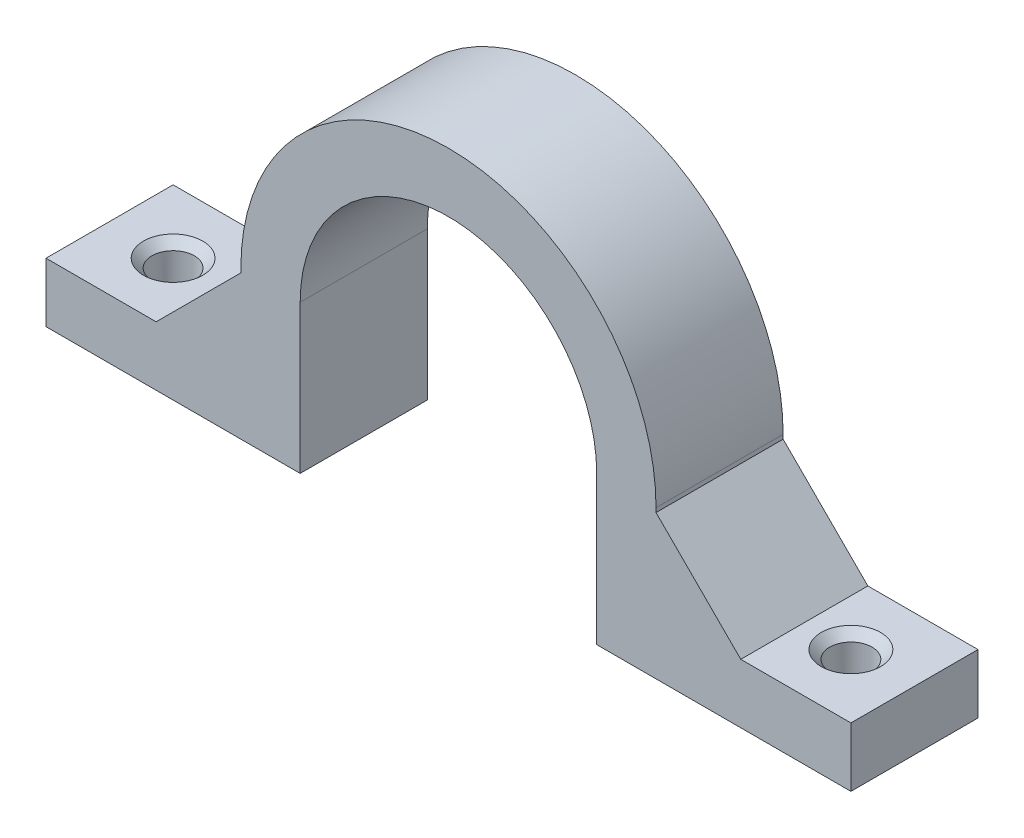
ISO-10303-21;
HEADER;
FILE_DESCRIPTION(('STEP AP214'),'2;1');
FILE_NAME('part.step','',(''),(''),'','','');
FILE_SCHEMA(('AUTOMOTIVE_DESIGN { 1 0 10303 214 1 1 1 1 }'));
ENDSEC;
DATA;
#1=APPLICATION_CONTEXT('core data for automotive mechanical design processes');
#2=APPLICATION_PROTOCOL_DEFINITION('international standard','automotive_design',2000,#1);
#3=PRODUCT_CONTEXT('',#1,'mechanical');
#4=PRODUCT('Part','Part','',(#3));
#5=PRODUCT_RELATED_PRODUCT_CATEGORY('part','',(#4));
#6=PRODUCT_DEFINITION_FORMATION('','',#4);
#7=PRODUCT_DEFINITION_CONTEXT('part definition',#1,'design');
#8=PRODUCT_DEFINITION('design','',#6,#7);
#9=PRODUCT_DEFINITION_SHAPE('','',#8);
#10=(LENGTH_UNIT() NAMED_UNIT(*) SI_UNIT(.MILLI.,.METRE.));
#11=(NAMED_UNIT(*) PLANE_ANGLE_UNIT() SI_UNIT($,.RADIAN.));
#12=(NAMED_UNIT(*) SI_UNIT($,.STERADIAN.) SOLID_ANGLE_UNIT());
#13=UNCERTAINTY_MEASURE_WITH_UNIT(LENGTH_MEASURE(1.E-05),#10,'distance_accuracy_value','');
#14=(GEOMETRIC_REPRESENTATION_CONTEXT(3) GLOBAL_UNCERTAINTY_ASSIGNED_CONTEXT((#13)) GLOBAL_UNIT_ASSIGNED_CONTEXT((#10,
#11,#12)) REPRESENTATION_CONTEXT('',''));
#15=CARTESIAN_POINT('',(0.,0.,0.));
#16=DIRECTION('',(0.,0.,1.));
#17=DIRECTION('',(1.,0.,0.));
#18=AXIS2_PLACEMENT_3D('',#15,#16,#17);
#19=CARTESIAN_POINT('',(0.,7.,15.));
#20=DIRECTION('',(1.,0.,0.));
#21=DIRECTION('',(0.,0.,-1.));
#22=AXIS2_PLACEMENT_3D('',#19,#20,#21);
#23=PLANE('',#22);
#24=DIRECTION('',(0.,-1.,0.));
#25=VECTOR('',#24,1.);
#26=CARTESIAN_POINT('',(0.,7.,0.));
#27=LINE('',#26,#25);
#28=CARTESIAN_POINT('',(0.,7.,0.));
#29=VERTEX_POINT('',#28);
#30=CARTESIAN_POINT('',(0.,0.,0.));
#31=VERTEX_POINT('',#30);
#32=EDGE_CURVE('E164',#29,#31,#27,.T.);
#33=ORIENTED_EDGE('',*,*,#32,.T.);
#34=DIRECTION('',(0.,0.,-1.));
#35=VECTOR('',#34,1.);
#36=CARTESIAN_POINT('',(0.,0.,15.));
#37=LINE('',#36,#35);
#38=CARTESIAN_POINT('',(0.,0.,15.));
#39=VERTEX_POINT('',#38);
#40=EDGE_CURVE('E145',#39,#31,#37,.T.);
#41=ORIENTED_EDGE('',*,*,#40,.F.);
#42=DIRECTION('',(0.,-1.,0.));
#43=VECTOR('',#42,1.);
#44=CARTESIAN_POINT('',(0.,7.,15.));
#45=LINE('',#44,#43);
#46=CARTESIAN_POINT('',(0.,7.,15.));
#47=VERTEX_POINT('',#46);
#48=EDGE_CURVE('E152',#47,#39,#45,.T.);
#49=ORIENTED_EDGE('',*,*,#48,.F.);
#50=DIRECTION('',(0.,0.,-1.));
#51=VECTOR('',#50,1.);
#52=CARTESIAN_POINT('',(0.,7.,15.));
#53=LINE('',#52,#51);
#54=EDGE_CURVE('E261',#47,#29,#53,.T.);
#55=ORIENTED_EDGE('',*,*,#54,.T.);
#56=EDGE_LOOP('',(#33,#41,#49,#55));
#57=FACE_BOUND('',#56,.T.);
#58=ADVANCED_FACE('F37',(#57),#23,.F.);
#59=CARTESIAN_POINT('',(0.,0.,15.));
#60=DIRECTION('',(0.,1.,0.));
#61=DIRECTION('',(0.,0.,1.));
#62=AXIS2_PLACEMENT_3D('',#59,#60,#61);
#63=PLANE('',#62);
#64=CARTESIAN_POINT('',(7.5,0.,7.5));
#65=DIRECTION('',(0.,1.,0.));
#66=DIRECTION('',(0.,0.,1.));
#67=AXIS2_PLACEMENT_3D('',#64,#65,#66);
#68=CIRCLE('',#67,2.5);
#69=CARTESIAN_POINT('',(7.5,0.,10.));
#70=VERTEX_POINT('',#69);
#71=EDGE_CURVE('E333',#70,#70,#68,.T.);
#72=ORIENTED_EDGE('',*,*,#71,.T.);
#73=EDGE_LOOP('',(#72));
#74=FACE_BOUND('',#73,.T.);
#75=DIRECTION('',(1.,0.,0.));
#76=VECTOR('',#75,1.);
#77=CARTESIAN_POINT('',(0.,0.,0.));
#78=LINE('',#77,#76);
#79=CARTESIAN_POINT('',(30.,0.,0.));
#80=VERTEX_POINT('',#79);
#81=EDGE_CURVE('E263',#31,#80,#78,.T.);
#82=ORIENTED_EDGE('',*,*,#81,.T.);
#83=DIRECTION('',(0.,0.,-1.));
#84=VECTOR('',#83,1.);
#85=CARTESIAN_POINT('',(30.,0.,15.));
#86=LINE('',#85,#84);
#87=CARTESIAN_POINT('',(30.,0.,15.));
#88=VERTEX_POINT('',#87);
#89=EDGE_CURVE('E148',#88,#80,#86,.T.);
#90=ORIENTED_EDGE('',*,*,#89,.F.);
#91=DIRECTION('',(1.,0.,0.));
#92=VECTOR('',#91,1.);
#93=CARTESIAN_POINT('',(0.,0.,15.));
#94=LINE('',#93,#92);
#95=EDGE_CURVE('E141',#39,#88,#94,.T.);
#96=ORIENTED_EDGE('',*,*,#95,.F.);
#97=ORIENTED_EDGE('',*,*,#40,.T.);
#98=EDGE_LOOP('',(#82,#90,#96,#97));
#99=FACE_BOUND('',#98,.T.);
#100=ADVANCED_FACE('F143',(#74,#99),#63,.F.);
#101=CARTESIAN_POINT('',(30.,0.,15.));
#102=DIRECTION('',(-1.,0.,0.));
#103=DIRECTION('',(0.,-1.,0.));
#104=AXIS2_PLACEMENT_3D('',#101,#102,#103);
#105=PLANE('',#104);
#106=DIRECTION('',(0.,1.,0.));
#107=VECTOR('',#106,1.);
#108=CARTESIAN_POINT('',(30.,0.,0.));
#109=LINE('',#108,#107);
#110=CARTESIAN_POINT('',(30.,17.5,0.));
#111=VERTEX_POINT('',#110);
#112=EDGE_CURVE('E266',#80,#111,#109,.T.);
#113=ORIENTED_EDGE('',*,*,#112,.T.);
#114=DIRECTION('',(0.,0.,-1.));
#115=VECTOR('',#114,1.);
#116=CARTESIAN_POINT('',(30.,17.5,15.));
#117=LINE('',#116,#115);
#118=CARTESIAN_POINT('',(30.,17.5,15.));
#119=VERTEX_POINT('',#118);
#120=EDGE_CURVE('E170',#119,#111,#117,.T.);
#121=ORIENTED_EDGE('',*,*,#120,.F.);
#122=DIRECTION('',(0.,1.,0.));
#123=VECTOR('',#122,1.);
#124=CARTESIAN_POINT('',(30.,0.,15.));
#125=LINE('',#124,#123);
#126=EDGE_CURVE('E151',#88,#119,#125,.T.);
#127=ORIENTED_EDGE('',*,*,#126,.F.);
#128=ORIENTED_EDGE('',*,*,#89,.T.);
#129=EDGE_LOOP('',(#113,#121,#127,#128));
#130=FACE_BOUND('',#129,.T.);
#131=ADVANCED_FACE('F211',(#130),#105,.F.);
#132=CARTESIAN_POINT('',(47.5,17.5,15.));
#133=DIRECTION('',(0.,0.,-1.));
#134=DIRECTION('',(-1.,0.,0.));
#135=AXIS2_PLACEMENT_3D('',#132,#133,#134);
#136=CYLINDRICAL_SURFACE('',#135,17.5);
#137=CARTESIAN_POINT('',(47.5,17.5,0.));
#138=DIRECTION('',(0.,0.,-1.));
#139=DIRECTION('',(-1.,0.,0.));
#140=AXIS2_PLACEMENT_3D('',#137,#138,#139);
#141=CIRCLE('',#140,17.5);
#142=CARTESIAN_POINT('',(65.,17.5,0.));
#143=VERTEX_POINT('',#142);
#144=EDGE_CURVE('E268',#111,#143,#141,.T.);
#145=ORIENTED_EDGE('',*,*,#144,.T.);
#146=DIRECTION('',(0.,0.,-1.));
#147=VECTOR('',#146,1.);
#148=CARTESIAN_POINT('',(65.,17.5,15.));
#149=LINE('',#148,#147);
#150=CARTESIAN_POINT('',(65.,17.5,15.));
#151=VERTEX_POINT('',#150);
#152=EDGE_CURVE('E300',#151,#143,#149,.T.);
#153=ORIENTED_EDGE('',*,*,#152,.F.);
#154=CARTESIAN_POINT('',(47.5,17.5,15.));
#155=DIRECTION('',(0.,0.,-1.));
#156=DIRECTION('',(-1.,0.,0.));
#157=AXIS2_PLACEMENT_3D('',#154,#155,#156);
#158=CIRCLE('',#157,17.5);
#159=EDGE_CURVE('E309',#119,#151,#158,.T.);
#160=ORIENTED_EDGE('',*,*,#159,.F.);
#161=ORIENTED_EDGE('',*,*,#120,.T.);
#162=EDGE_LOOP('',(#145,#153,#160,#161));
#163=FACE_BOUND('',#162,.T.);
#164=ADVANCED_FACE('F307',(#163),#136,.F.);
#165=CARTESIAN_POINT('',(65.,17.5,15.));
#166=DIRECTION('',(1.,0.,0.));
#167=DIRECTION('',(0.,0.,-1.));
#168=AXIS2_PLACEMENT_3D('',#165,#166,#167);
#169=PLANE('',#168);
#170=DIRECTION('',(0.,-1.,0.));
#171=VECTOR('',#170,1.);
#172=CARTESIAN_POINT('',(65.,17.5,0.));
#173=LINE('',#172,#171);
#174=CARTESIAN_POINT('',(65.,0.,0.));
#175=VERTEX_POINT('',#174);
#176=EDGE_CURVE('E270',#143,#175,#173,.T.);
#177=ORIENTED_EDGE('',*,*,#176,.T.);
#178=DIRECTION('',(0.,0.,-1.));
#179=VECTOR('',#178,1.);
#180=CARTESIAN_POINT('',(65.,0.,15.));
#181=LINE('',#180,#179);
#182=CARTESIAN_POINT('',(65.,0.,15.));
#183=VERTEX_POINT('',#182);
#184=EDGE_CURVE('E297',#183,#175,#181,.T.);
#185=ORIENTED_EDGE('',*,*,#184,.F.);
#186=DIRECTION('',(0.,-1.,0.));
#187=VECTOR('',#186,1.);
#188=CARTESIAN_POINT('',(65.,17.5,15.));
#189=LINE('',#188,#187);
#190=EDGE_CURVE('E325',#151,#183,#189,.T.);
#191=ORIENTED_EDGE('',*,*,#190,.F.);
#192=ORIENTED_EDGE('',*,*,#152,.T.);
#193=EDGE_LOOP('',(#177,#185,#191,#192));
#194=FACE_BOUND('',#193,.T.);
#195=ADVANCED_FACE('F317',(#194),#169,.F.);
#196=CARTESIAN_POINT('',(65.,0.,15.));
#197=DIRECTION('',(0.,1.,0.));
#198=DIRECTION('',(0.,0.,1.));
#199=AXIS2_PLACEMENT_3D('',#196,#197,#198);
#200=PLANE('',#199);
#201=CARTESIAN_POINT('',(87.5,0.,7.5));
#202=DIRECTION('',(0.,1.,0.));
#203=DIRECTION('',(0.,0.,1.));
#204=AXIS2_PLACEMENT_3D('',#201,#202,#203);
#205=CIRCLE('',#204,2.5);
#206=CARTESIAN_POINT('',(87.5,0.,9.99999999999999));
#207=VERTEX_POINT('',#206);
#208=EDGE_CURVE('E264',#207,#207,#205,.T.);
#209=ORIENTED_EDGE('',*,*,#208,.T.);
#210=EDGE_LOOP('',(#209));
#211=FACE_BOUND('',#210,.T.);
#212=DIRECTION('',(1.,0.,0.));
#213=VECTOR('',#212,1.);
#214=CARTESIAN_POINT('',(65.,0.,0.));
#215=LINE('',#214,#213);
#216=CARTESIAN_POINT('',(95.,0.,0.));
#217=VERTEX_POINT('',#216);
#218=EDGE_CURVE('E272',#175,#217,#215,.T.);
#219=ORIENTED_EDGE('',*,*,#218,.T.);
#220=DIRECTION('',(0.,0.,-1.));
#221=VECTOR('',#220,1.);
#222=CARTESIAN_POINT('',(95.,0.,15.));
#223=LINE('',#222,#221);
#224=CARTESIAN_POINT('',(95.,0.,15.));
#225=VERTEX_POINT('',#224);
#226=EDGE_CURVE('E294',#225,#217,#223,.T.);
#227=ORIENTED_EDGE('',*,*,#226,.F.);
#228=DIRECTION('',(1.,0.,0.));
#229=VECTOR('',#228,1.);
#230=CARTESIAN_POINT('',(65.,0.,15.));
#231=LINE('',#230,#229);
#232=EDGE_CURVE('E323',#183,#225,#231,.T.);
#233=ORIENTED_EDGE('',*,*,#232,.F.);
#234=ORIENTED_EDGE('',*,*,#184,.T.);
#235=EDGE_LOOP('',(#219,#227,#233,#234));
#236=FACE_BOUND('',#235,.T.);
#237=ADVANCED_FACE('F321',(#211,#236),#200,.F.);
#238=CARTESIAN_POINT('',(95.,7.,15.));
#239=DIRECTION('',(-1.,0.,0.));
#240=DIRECTION('',(0.,0.,1.));
#241=AXIS2_PLACEMENT_3D('',#238,#239,#240);
#242=PLANE('',#241);
#243=DIRECTION('',(0.,1.,0.));
#244=VECTOR('',#243,1.);
#245=CARTESIAN_POINT('',(95.,7.,0.));
#246=LINE('',#245,#244);
#247=CARTESIAN_POINT('',(95.,7.,0.));
#248=VERTEX_POINT('',#247);
#249=EDGE_CURVE('E274',#217,#248,#246,.T.);
#250=ORIENTED_EDGE('',*,*,#249,.T.);
#251=DIRECTION('',(0.,0.,-1.));
#252=VECTOR('',#251,1.);
#253=CARTESIAN_POINT('',(95.,7.,15.));
#254=LINE('',#253,#252);
#255=CARTESIAN_POINT('',(95.,7.,15.));
#256=VERTEX_POINT('',#255);
#257=EDGE_CURVE('E291',#256,#248,#254,.T.);
#258=ORIENTED_EDGE('',*,*,#257,.F.);
#259=DIRECTION('',(0.,1.,0.));
#260=VECTOR('',#259,1.);
#261=CARTESIAN_POINT('',(95.,7.,15.));
#262=LINE('',#261,#260);
#263=EDGE_CURVE('E254',#225,#256,#262,.T.);
#264=ORIENTED_EDGE('',*,*,#263,.F.);
#265=ORIENTED_EDGE('',*,*,#226,.T.);
#266=EDGE_LOOP('',(#250,#258,#264,#265));
#267=FACE_BOUND('',#266,.T.);
#268=ADVANCED_FACE('F366',(#267),#242,.F.);
#269=CARTESIAN_POINT('',(72.,7.,15.));
#270=DIRECTION('',(0.,-1.,0.));
#271=DIRECTION('',(0.,0.,-1.));
#272=AXIS2_PLACEMENT_3D('',#269,#270,#271);
#273=PLANE('',#272);
#274=CARTESIAN_POINT('',(87.5,7.,7.5));
#275=DIRECTION('',(0.,-1.,0.));
#276=DIRECTION('',(0.,0.,-1.));
#277=AXIS2_PLACEMENT_3D('',#274,#275,#276);
#278=CIRCLE('',#277,3.50000000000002);
#279=CARTESIAN_POINT('',(87.5,7.,3.99999999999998));
#280=VERTEX_POINT('',#279);
#281=EDGE_CURVE('E189',#280,#280,#278,.T.);
#282=ORIENTED_EDGE('',*,*,#281,.T.);
#283=EDGE_LOOP('',(#282));
#284=FACE_BOUND('',#283,.T.);
#285=DIRECTION('',(-1.,0.,0.));
#286=VECTOR('',#285,1.);
#287=CARTESIAN_POINT('',(72.,7.,0.));
#288=LINE('',#287,#286);
#289=CARTESIAN_POINT('',(82.,7.,0.));
#290=VERTEX_POINT('',#289);
#291=EDGE_CURVE('E276',#248,#290,#288,.T.);
#292=ORIENTED_EDGE('',*,*,#291,.T.);
#293=DIRECTION('',(0.,0.,1.));
#294=VECTOR('',#293,1.);
#295=CARTESIAN_POINT('',(82.,7.,15.));
#296=LINE('',#295,#294);
#297=CARTESIAN_POINT('',(82.,7.,15.));
#298=VERTEX_POINT('',#297);
#299=EDGE_CURVE('E53',#290,#298,#296,.T.);
#300=ORIENTED_EDGE('',*,*,#299,.T.);
#301=DIRECTION('',(-1.,0.,0.));
#302=VECTOR('',#301,1.);
#303=CARTESIAN_POINT('',(72.,7.,15.));
#304=LINE('',#303,#302);
#305=EDGE_CURVE('E244',#256,#298,#304,.T.);
#306=ORIENTED_EDGE('',*,*,#305,.F.);
#307=ORIENTED_EDGE('',*,*,#257,.T.);
#308=EDGE_LOOP('',(#292,#300,#306,#307));
#309=FACE_BOUND('',#308,.T.);
#310=ADVANCED_FACE('F363',(#284,#309),#273,.F.);
#311=CARTESIAN_POINT('',(72.,17.5,15.));
#312=DIRECTION('',(-1.,0.,0.));
#313=DIRECTION('',(0.,0.,1.));
#314=AXIS2_PLACEMENT_3D('',#311,#312,#313);
#315=PLANE('',#314);
#316=DIRECTION('',(0.,1.,0.));
#317=VECTOR('',#316,1.);
#318=CARTESIAN_POINT('',(72.,17.5,15.));
#319=LINE('',#318,#317);
#320=CARTESIAN_POINT('',(72.,17.0000000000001,15.));
#321=VERTEX_POINT('',#320);
#322=CARTESIAN_POINT('',(72.,17.5,15.));
#323=VERTEX_POINT('',#322);
#324=EDGE_CURVE('E242',#321,#323,#319,.T.);
#325=ORIENTED_EDGE('',*,*,#324,.F.);
#326=DIRECTION('',(0.,0.,-1.));
#327=VECTOR('',#326,1.);
#328=CARTESIAN_POINT('',(72.,17.0000000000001,0.));
#329=LINE('',#328,#327);
#330=CARTESIAN_POINT('',(72.,17.0000000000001,0.));
#331=VERTEX_POINT('',#330);
#332=EDGE_CURVE('E175',#321,#331,#329,.T.);
#333=ORIENTED_EDGE('',*,*,#332,.T.);
#334=DIRECTION('',(0.,1.,0.));
#335=VECTOR('',#334,1.);
#336=CARTESIAN_POINT('',(72.,17.5,0.));
#337=LINE('',#336,#335);
#338=CARTESIAN_POINT('',(72.,17.5,0.));
#339=VERTEX_POINT('',#338);
#340=EDGE_CURVE('E278',#331,#339,#337,.T.);
#341=ORIENTED_EDGE('',*,*,#340,.T.);
#342=DIRECTION('',(0.,0.,-1.));
#343=VECTOR('',#342,1.);
#344=CARTESIAN_POINT('',(72.,17.5,15.));
#345=LINE('',#344,#343);
#346=EDGE_CURVE('E248',#323,#339,#345,.T.);
#347=ORIENTED_EDGE('',*,*,#346,.F.);
#348=EDGE_LOOP('',(#325,#333,#341,#347));
#349=FACE_BOUND('',#348,.T.);
#350=ADVANCED_FACE('F246',(#349),#315,.F.);
#351=CARTESIAN_POINT('',(47.5,17.5,15.));
#352=DIRECTION('',(0.,0.,-1.));
#353=DIRECTION('',(-1.,0.,0.));
#354=AXIS2_PLACEMENT_3D('',#351,#352,#353);
#355=CYLINDRICAL_SURFACE('',#354,24.5);
#356=CARTESIAN_POINT('',(47.5,17.5,0.));
#357=DIRECTION('',(0.,0.,1.));
#358=DIRECTION('',(-1.,0.,0.));
#359=AXIS2_PLACEMENT_3D('',#356,#357,#358);
#360=CIRCLE('',#359,24.5);
#361=CARTESIAN_POINT('',(23.,17.5,0.));
#362=VERTEX_POINT('',#361);
#363=EDGE_CURVE('E280',#339,#362,#360,.T.);
#364=ORIENTED_EDGE('',*,*,#363,.T.);
#365=DIRECTION('',(0.,0.,-1.));
#366=VECTOR('',#365,1.);
#367=CARTESIAN_POINT('',(23.,17.5,15.));
#368=LINE('',#367,#366);
#369=CARTESIAN_POINT('',(23.,17.5,15.));
#370=VERTEX_POINT('',#369);
#371=EDGE_CURVE('E287',#370,#362,#368,.T.);
#372=ORIENTED_EDGE('',*,*,#371,.F.);
#373=CARTESIAN_POINT('',(47.5,17.5,15.));
#374=DIRECTION('',(0.,0.,1.));
#375=DIRECTION('',(-1.,0.,0.));
#376=AXIS2_PLACEMENT_3D('',#373,#374,#375);
#377=CIRCLE('',#376,24.5);
#378=EDGE_CURVE('E250',#323,#370,#377,.T.);
#379=ORIENTED_EDGE('',*,*,#378,.F.);
#380=ORIENTED_EDGE('',*,*,#346,.T.);
#381=EDGE_LOOP('',(#364,#372,#379,#380));
#382=FACE_BOUND('',#381,.T.);
#383=ADVANCED_FACE('F356',(#382),#355,.T.);
#384=CARTESIAN_POINT('',(23.,7.,15.));
#385=DIRECTION('',(1.,0.,0.));
#386=DIRECTION('',(0.,0.,-1.));
#387=AXIS2_PLACEMENT_3D('',#384,#385,#386);
#388=PLANE('',#387);
#389=DIRECTION('',(0.,-1.,0.));
#390=VECTOR('',#389,1.);
#391=CARTESIAN_POINT('',(23.,7.,0.));
#392=LINE('',#391,#390);
#393=CARTESIAN_POINT('',(23.,17.,0.));
#394=VERTEX_POINT('',#393);
#395=EDGE_CURVE('E282',#362,#394,#392,.T.);
#396=ORIENTED_EDGE('',*,*,#395,.T.);
#397=DIRECTION('',(0.,0.,1.));
#398=VECTOR('',#397,1.);
#399=CARTESIAN_POINT('',(23.,17.,15.));
#400=LINE('',#399,#398);
#401=CARTESIAN_POINT('',(23.,17.,15.));
#402=VERTEX_POINT('',#401);
#403=EDGE_CURVE('E168',#394,#402,#400,.T.);
#404=ORIENTED_EDGE('',*,*,#403,.T.);
#405=DIRECTION('',(0.,-1.,0.));
#406=VECTOR('',#405,1.);
#407=CARTESIAN_POINT('',(23.,7.,15.));
#408=LINE('',#407,#406);
#409=EDGE_CURVE('E252',#370,#402,#408,.T.);
#410=ORIENTED_EDGE('',*,*,#409,.F.);
#411=ORIENTED_EDGE('',*,*,#371,.T.);
#412=EDGE_LOOP('',(#396,#404,#410,#411));
#413=FACE_BOUND('',#412,.T.);
#414=ADVANCED_FACE('F352',(#413),#388,.F.);
#415=CARTESIAN_POINT('',(0.,7.,15.));
#416=DIRECTION('',(0.,-1.,0.));
#417=DIRECTION('',(0.,0.,-1.));
#418=AXIS2_PLACEMENT_3D('',#415,#416,#417);
#419=PLANE('',#418);
#420=CARTESIAN_POINT('',(7.5,7.,7.5));
#421=DIRECTION('',(0.,-1.,0.));
#422=DIRECTION('',(0.,0.,-1.));
#423=AXIS2_PLACEMENT_3D('',#420,#421,#422);
#424=CIRCLE('',#423,3.50000000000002);
#425=CARTESIAN_POINT('',(7.5,7.,3.99999999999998));
#426=VERTEX_POINT('',#425);
#427=EDGE_CURVE('E11',#426,#426,#424,.T.);
#428=ORIENTED_EDGE('',*,*,#427,.T.);
#429=EDGE_LOOP('',(#428));
#430=FACE_BOUND('',#429,.T.);
#431=DIRECTION('',(-1.,0.,0.));
#432=VECTOR('',#431,1.);
#433=CARTESIAN_POINT('',(0.,7.,15.));
#434=LINE('',#433,#432);
#435=CARTESIAN_POINT('',(12.9999999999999,7.,15.));
#436=VERTEX_POINT('',#435);
#437=EDGE_CURVE('E157',#436,#47,#434,.T.);
#438=ORIENTED_EDGE('',*,*,#437,.F.);
#439=DIRECTION('',(0.,0.,-1.));
#440=VECTOR('',#439,1.);
#441=CARTESIAN_POINT('',(12.9999999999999,7.,0.));
#442=LINE('',#441,#440);
#443=CARTESIAN_POINT('',(12.9999999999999,7.,0.));
#444=VERTEX_POINT('',#443);
#445=EDGE_CURVE('E165',#436,#444,#442,.T.);
#446=ORIENTED_EDGE('',*,*,#445,.T.);
#447=DIRECTION('',(-1.,0.,0.));
#448=VECTOR('',#447,1.);
#449=CARTESIAN_POINT('',(0.,7.,0.));
#450=LINE('',#449,#448);
#451=EDGE_CURVE('E161',#444,#29,#450,.T.);
#452=ORIENTED_EDGE('',*,*,#451,.T.);
#453=ORIENTED_EDGE('',*,*,#54,.F.);
#454=EDGE_LOOP('',(#438,#446,#452,#453));
#455=FACE_BOUND('',#454,.T.);
#456=ADVANCED_FACE('F347',(#430,#455),#419,.F.);
#457=CARTESIAN_POINT('',(47.5,17.5,15.));
#458=DIRECTION('',(0.,0.,-1.));
#459=DIRECTION('',(-1.,0.,0.));
#460=AXIS2_PLACEMENT_3D('',#457,#458,#459);
#461=PLANE('',#460);
#462=ORIENTED_EDGE('',*,*,#48,.T.);
#463=ORIENTED_EDGE('',*,*,#95,.T.);
#464=ORIENTED_EDGE('',*,*,#126,.T.);
#465=ORIENTED_EDGE('',*,*,#159,.T.);
#466=ORIENTED_EDGE('',*,*,#190,.T.);
#467=ORIENTED_EDGE('',*,*,#232,.T.);
#468=ORIENTED_EDGE('',*,*,#263,.T.);
#469=ORIENTED_EDGE('',*,*,#305,.T.);
#470=DIRECTION('',(0.707106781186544,-0.707106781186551,0.));
#471=VECTOR('',#470,1.);
#472=CARTESIAN_POINT('',(59.5000000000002,29.5,15.));
#473=LINE('',#472,#471);
#474=EDGE_CURVE('E184',#298,#321,#473,.F.);
#475=ORIENTED_EDGE('',*,*,#474,.T.);
#476=ORIENTED_EDGE('',*,*,#324,.T.);
#477=ORIENTED_EDGE('',*,*,#378,.T.);
#478=ORIENTED_EDGE('',*,*,#409,.T.);
#479=DIRECTION('',(0.707106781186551,0.707106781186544,0.));
#480=VECTOR('',#479,1.);
#481=CARTESIAN_POINT('',(35.5000000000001,29.5,15.));
#482=LINE('',#481,#480);
#483=EDGE_CURVE('E181',#402,#436,#482,.F.);
#484=ORIENTED_EDGE('',*,*,#483,.T.);
#485=ORIENTED_EDGE('',*,*,#437,.T.);
#486=EDGE_LOOP('',(#462,#463,#464,#465,#466,#467,#468,#469,#475,#476,#477,#478,#484,#485));
#487=FACE_BOUND('',#486,.T.);
#488=ADVANCED_FACE('F155',(#487),#461,.F.);
#489=CARTESIAN_POINT('',(47.5,17.5,0.));
#490=DIRECTION('',(0.,0.,-1.));
#491=DIRECTION('',(-1.,0.,0.));
#492=AXIS2_PLACEMENT_3D('',#489,#490,#491);
#493=PLANE('',#492);
#494=ORIENTED_EDGE('',*,*,#32,.F.);
#495=ORIENTED_EDGE('',*,*,#451,.F.);
#496=DIRECTION('',(-0.707106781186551,-0.707106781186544,0.));
#497=VECTOR('',#496,1.);
#498=CARTESIAN_POINT('',(12.9999999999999,7.,0.));
#499=LINE('',#498,#497);
#500=EDGE_CURVE('E179',#444,#394,#499,.F.);
#501=ORIENTED_EDGE('',*,*,#500,.T.);
#502=ORIENTED_EDGE('',*,*,#395,.F.);
#503=ORIENTED_EDGE('',*,*,#363,.F.);
#504=ORIENTED_EDGE('',*,*,#340,.F.);
#505=DIRECTION('',(-0.707106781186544,0.707106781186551,0.));
#506=VECTOR('',#505,1.);
#507=CARTESIAN_POINT('',(72.,17.0000000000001,0.));
#508=LINE('',#507,#506);
#509=EDGE_CURVE('E61',#331,#290,#508,.F.);
#510=ORIENTED_EDGE('',*,*,#509,.T.);
#511=ORIENTED_EDGE('',*,*,#291,.F.);
#512=ORIENTED_EDGE('',*,*,#249,.F.);
#513=ORIENTED_EDGE('',*,*,#218,.F.);
#514=ORIENTED_EDGE('',*,*,#176,.F.);
#515=ORIENTED_EDGE('',*,*,#144,.F.);
#516=ORIENTED_EDGE('',*,*,#112,.F.);
#517=ORIENTED_EDGE('',*,*,#81,.F.);
#518=EDGE_LOOP('',(#494,#495,#501,#502,#503,#504,#510,#511,#512,#513,#514,#515,#516,#517));
#519=FACE_BOUND('',#518,.T.);
#520=ADVANCED_FACE('F224',(#519),#493,.T.);
#521=CARTESIAN_POINT('',(12.9999999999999,7.,15.));
#522=DIRECTION('',(-0.707106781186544,0.707106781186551,0.));
#523=DIRECTION('',(0.,0.,1.));
#524=AXIS2_PLACEMENT_3D('',#521,#522,#523);
#525=PLANE('',#524);
#526=ORIENTED_EDGE('',*,*,#483,.F.);
#527=ORIENTED_EDGE('',*,*,#403,.F.);
#528=ORIENTED_EDGE('',*,*,#500,.F.);
#529=ORIENTED_EDGE('',*,*,#445,.F.);
#530=EDGE_LOOP('',(#526,#527,#528,#529));
#531=FACE_BOUND('',#530,.T.);
#532=ADVANCED_FACE('F217',(#531),#525,.T.);
#533=CARTESIAN_POINT('',(72.,17.0000000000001,15.));
#534=DIRECTION('',(0.707106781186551,0.707106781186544,0.));
#535=DIRECTION('',(0.,0.,1.));
#536=AXIS2_PLACEMENT_3D('',#533,#534,#535);
#537=PLANE('',#536);
#538=ORIENTED_EDGE('',*,*,#474,.F.);
#539=ORIENTED_EDGE('',*,*,#299,.F.);
#540=ORIENTED_EDGE('',*,*,#509,.F.);
#541=ORIENTED_EDGE('',*,*,#332,.F.);
#542=EDGE_LOOP('',(#538,#539,#540,#541));
#543=FACE_BOUND('',#542,.T.);
#544=ADVANCED_FACE('F223',(#543),#537,.T.);
#545=CARTESIAN_POINT('',(7.5,-8.,7.5));
#546=DIRECTION('',(0.,1.,0.));
#547=DIRECTION('',(0.,0.,1.));
#548=AXIS2_PLACEMENT_3D('',#545,#546,#547);
#549=CYLINDRICAL_SURFACE('',#548,2.5);
#550=CARTESIAN_POINT('',(7.5,5.99999999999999,7.5));
#551=DIRECTION('',(0.,-1.,0.));
#552=DIRECTION('',(0.,0.,-1.));
#553=AXIS2_PLACEMENT_3D('',#550,#551,#552);
#554=CIRCLE('',#553,2.5);
#555=CARTESIAN_POINT('',(7.5,5.99999999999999,5.));
#556=VERTEX_POINT('',#555);
#557=EDGE_CURVE('E46',#556,#556,#554,.F.);
#558=ORIENTED_EDGE('',*,*,#557,.T.);
#559=EDGE_LOOP('',(#558));
#560=FACE_BOUND('',#559,.T.);
#561=ORIENTED_EDGE('',*,*,#71,.F.);
#562=EDGE_LOOP('',(#561));
#563=FACE_BOUND('',#562,.T.);
#564=ADVANCED_FACE('F194',(#560,#563),#549,.F.);
#565=CARTESIAN_POINT('',(87.5,-8.,7.5));
#566=DIRECTION('',(0.,1.,0.));
#567=DIRECTION('',(0.,0.,1.));
#568=AXIS2_PLACEMENT_3D('',#565,#566,#567);
#569=CYLINDRICAL_SURFACE('',#568,2.5);
#570=CARTESIAN_POINT('',(87.5,5.99999999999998,7.5));
#571=DIRECTION('',(0.,-1.,0.));
#572=DIRECTION('',(0.,0.,-1.));
#573=AXIS2_PLACEMENT_3D('',#570,#571,#572);
#574=CIRCLE('',#573,2.5);
#575=CARTESIAN_POINT('',(87.5,5.99999999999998,5.));
#576=VERTEX_POINT('',#575);
#577=EDGE_CURVE('E186',#576,#576,#574,.F.);
#578=ORIENTED_EDGE('',*,*,#577,.T.);
#579=EDGE_LOOP('',(#578));
#580=FACE_BOUND('',#579,.T.);
#581=ORIENTED_EDGE('',*,*,#208,.F.);
#582=EDGE_LOOP('',(#581));
#583=FACE_BOUND('',#582,.T.);
#584=ADVANCED_FACE('F203',(#580,#583),#569,.F.);
#585=CARTESIAN_POINT('',(87.5,5.99999999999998,7.5));
#586=DIRECTION('',(0.,1.,0.));
#587=DIRECTION('',(0.,0.,1.));
#588=AXIS2_PLACEMENT_3D('',#585,#586,#587);
#589=CONICAL_SURFACE('',#588,2.5,0.785398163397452);
#590=ORIENTED_EDGE('',*,*,#281,.F.);
#591=EDGE_LOOP('',(#590));
#592=FACE_BOUND('',#591,.T.);
#593=ORIENTED_EDGE('',*,*,#577,.F.);
#594=EDGE_LOOP('',(#593));
#595=FACE_BOUND('',#594,.T.);
#596=ADVANCED_FACE('F198',(#592,#595),#589,.F.);
#597=CARTESIAN_POINT('',(7.5,5.99999999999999,7.5));
#598=DIRECTION('',(0.,1.,0.));
#599=DIRECTION('',(0.,0.,1.));
#600=AXIS2_PLACEMENT_3D('',#597,#598,#599);
#601=CONICAL_SURFACE('',#600,2.5,0.785398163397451);
#602=ORIENTED_EDGE('',*,*,#427,.F.);
#603=EDGE_LOOP('',(#602));
#604=FACE_BOUND('',#603,.T.);
#605=ORIENTED_EDGE('',*,*,#557,.F.);
#606=EDGE_LOOP('',(#605));
#607=FACE_BOUND('',#606,.T.);
#608=ADVANCED_FACE('F40',(#604,#607),#601,.F.);
#609=CLOSED_SHELL('',(#58,#100,#131,#164,#195,#237,#268,#310,#350,#383,#414,#456,#488,#520,#532,
#544,#564,#584,#596,#608));
#610=MANIFOLD_SOLID_BREP('B2',#609);
#611=ADVANCED_BREP_SHAPE_REPRESENTATION('',(#18,#610),#14);
#612=SHAPE_DEFINITION_REPRESENTATION(#9,#611);
ENDSEC;
END-ISO-10303-21;
